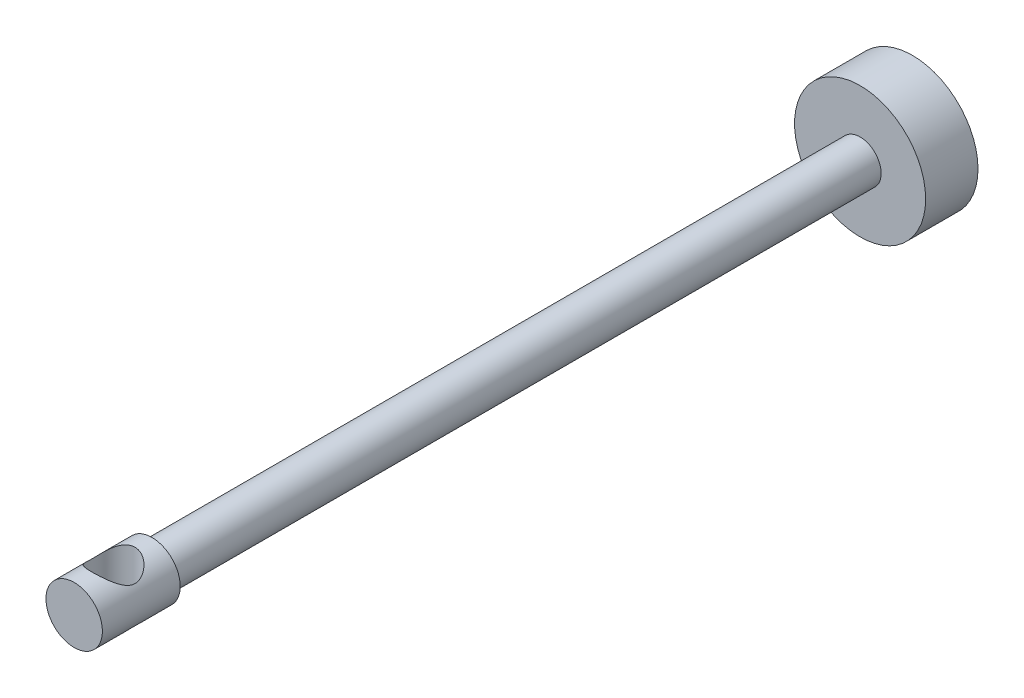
ISO-10303-21;
HEADER;
FILE_DESCRIPTION(('STEP AP214'),'2;1');
FILE_NAME('part.step','',(''),(''),'','','');
FILE_SCHEMA(('AUTOMOTIVE_DESIGN { 1 0 10303 214 1 1 1 1 }'));
ENDSEC;
DATA;
#1=APPLICATION_CONTEXT('core data for automotive mechanical design processes');
#2=APPLICATION_PROTOCOL_DEFINITION('international standard','automotive_design',2000,#1);
#3=PRODUCT_CONTEXT('',#1,'mechanical');
#4=PRODUCT('Part','Part','',(#3));
#5=PRODUCT_RELATED_PRODUCT_CATEGORY('part','',(#4));
#6=PRODUCT_DEFINITION_FORMATION('','',#4);
#7=PRODUCT_DEFINITION_CONTEXT('part definition',#1,'design');
#8=PRODUCT_DEFINITION('design','',#6,#7);
#9=PRODUCT_DEFINITION_SHAPE('','',#8);
#10=(LENGTH_UNIT() NAMED_UNIT(*) SI_UNIT(.MILLI.,.METRE.));
#11=(NAMED_UNIT(*) PLANE_ANGLE_UNIT() SI_UNIT($,.RADIAN.));
#12=(NAMED_UNIT(*) SI_UNIT($,.STERADIAN.) SOLID_ANGLE_UNIT());
#13=UNCERTAINTY_MEASURE_WITH_UNIT(LENGTH_MEASURE(1.E-05),#10,'distance_accuracy_value','');
#14=(GEOMETRIC_REPRESENTATION_CONTEXT(3) GLOBAL_UNCERTAINTY_ASSIGNED_CONTEXT((#13)) GLOBAL_UNIT_ASSIGNED_CONTEXT((#10,
#11,#12)) REPRESENTATION_CONTEXT('',''));
#15=CARTESIAN_POINT('',(0.,0.,0.));
#16=DIRECTION('',(0.,0.,1.));
#17=DIRECTION('',(1.,0.,0.));
#18=AXIS2_PLACEMENT_3D('',#15,#16,#17);
#19=CARTESIAN_POINT('',(0.,0.,93.5482000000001));
#20=DIRECTION('',(0.,0.,-1.));
#21=DIRECTION('',(-1.,0.,0.));
#22=AXIS2_PLACEMENT_3D('',#19,#20,#21);
#23=CYLINDRICAL_SURFACE('',#22,2.3495);
#24=CARTESIAN_POINT('',(0.,0.,5.842));
#25=DIRECTION('',(0.,0.,1.));
#26=DIRECTION('',(1.,0.,0.));
#27=AXIS2_PLACEMENT_3D('',#24,#25,#26);
#28=CIRCLE('',#27,2.3495);
#29=CARTESIAN_POINT('',(2.34950000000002,0.,5.842));
#30=VERTEX_POINT('',#29);
#31=EDGE_CURVE('E97',#30,#30,#28,.F.);
#32=ORIENTED_EDGE('',*,*,#31,.F.);
#33=EDGE_LOOP('',(#32));
#34=FACE_BOUND('',#33,.T.);
#35=CARTESIAN_POINT('',(0.,0.,84.8614000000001));
#36=DIRECTION('',(0.,0.,1.));
#37=DIRECTION('',(1.,0.,0.));
#38=AXIS2_PLACEMENT_3D('',#35,#36,#37);
#39=CIRCLE('',#38,2.3495);
#40=CARTESIAN_POINT('',(2.34950000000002,0.,84.8614000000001));
#41=VERTEX_POINT('',#40);
#42=EDGE_CURVE('E10',#41,#41,#39,.T.);
#43=ORIENTED_EDGE('',*,*,#42,.F.);
#44=EDGE_LOOP('',(#43));
#45=FACE_BOUND('',#44,.T.);
#46=ADVANCED_FACE('F30',(#34,#45),#23,.T.);
#47=CARTESIAN_POINT('',(0.,0.,5.842));
#48=DIRECTION('',(0.,0.,1.));
#49=DIRECTION('',(1.,0.,0.));
#50=AXIS2_PLACEMENT_3D('',#47,#48,#49);
#51=PLANE('',#50);
#52=CARTESIAN_POINT('',(0.,0.,5.842));
#53=DIRECTION('',(0.,0.,1.));
#54=DIRECTION('',(1.,0.,0.));
#55=AXIS2_PLACEMENT_3D('',#52,#53,#54);
#56=CIRCLE('',#55,7.3152);
#57=CARTESIAN_POINT('',(7.31520000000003,0.,5.842));
#58=VERTEX_POINT('',#57);
#59=EDGE_CURVE('E42',#58,#58,#56,.T.);
#60=ORIENTED_EDGE('',*,*,#59,.T.);
#61=EDGE_LOOP('',(#60));
#62=FACE_BOUND('',#61,.T.);
#63=ORIENTED_EDGE('',*,*,#31,.T.);
#64=EDGE_LOOP('',(#63));
#65=FACE_BOUND('',#64,.T.);
#66=ADVANCED_FACE('F77',(#62,#65),#51,.T.);
#67=CARTESIAN_POINT('',(0.,0.,5.842));
#68=DIRECTION('',(0.,0.,-1.));
#69=DIRECTION('',(-1.,0.,0.));
#70=AXIS2_PLACEMENT_3D('',#67,#68,#69);
#71=CYLINDRICAL_SURFACE('',#70,7.3152);
#72=ORIENTED_EDGE('',*,*,#59,.F.);
#73=EDGE_LOOP('',(#72));
#74=FACE_BOUND('',#73,.T.);
#75=CARTESIAN_POINT('',(0.,0.,0.));
#76=DIRECTION('',(0.,0.,1.));
#77=DIRECTION('',(1.,0.,0.));
#78=AXIS2_PLACEMENT_3D('',#75,#76,#77);
#79=CIRCLE('',#78,7.3152);
#80=CARTESIAN_POINT('',(7.31520000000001,0.,0.));
#81=VERTEX_POINT('',#80);
#82=EDGE_CURVE('E47',#81,#81,#79,.T.);
#83=ORIENTED_EDGE('',*,*,#82,.T.);
#84=EDGE_LOOP('',(#83));
#85=FACE_BOUND('',#84,.T.);
#86=ADVANCED_FACE('F32',(#74,#85),#71,.T.);
#87=CARTESIAN_POINT('',(0.,0.,0.));
#88=DIRECTION('',(0.,0.,1.));
#89=DIRECTION('',(1.,0.,0.));
#90=AXIS2_PLACEMENT_3D('',#87,#88,#89);
#91=PLANE('',#90);
#92=ORIENTED_EDGE('',*,*,#82,.F.);
#93=EDGE_LOOP('',(#92));
#94=FACE_BOUND('',#93,.T.);
#95=ADVANCED_FACE('F66',(#94),#91,.F.);
#96=CARTESIAN_POINT('',(0.,0.,84.8614000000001));
#97=DIRECTION('',(0.,0.,1.));
#98=DIRECTION('',(1.,0.,0.));
#99=AXIS2_PLACEMENT_3D('',#96,#97,#98);
#100=PLANE('',#99);
#101=CARTESIAN_POINT('',(0.,0.,84.8614000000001));
#102=DIRECTION('',(0.,0.,1.));
#103=DIRECTION('',(1.,0.,0.));
#104=AXIS2_PLACEMENT_3D('',#101,#102,#103);
#105=CIRCLE('',#104,3.1496);
#106=CARTESIAN_POINT('',(3.14960000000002,0.,84.8614000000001));
#107=VERTEX_POINT('',#106);
#108=EDGE_CURVE('E94',#107,#107,#105,.T.);
#109=ORIENTED_EDGE('',*,*,#108,.F.);
#110=EDGE_LOOP('',(#109));
#111=FACE_BOUND('',#110,.T.);
#112=ORIENTED_EDGE('',*,*,#42,.T.);
#113=EDGE_LOOP('',(#112));
#114=FACE_BOUND('',#113,.T.);
#115=ADVANCED_FACE('F63',(#111,#114),#100,.F.);
#116=CARTESIAN_POINT('',(0.,0.,84.8614000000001));
#117=DIRECTION('',(0.,0.,1.));
#118=DIRECTION('',(1.,0.,0.));
#119=AXIS2_PLACEMENT_3D('',#116,#117,#118);
#120=CYLINDRICAL_SURFACE('',#119,3.1496);
#121=CARTESIAN_POINT('',(0.,-3.14959999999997,91.5543));
#122=CARTESIAN_POINT('',(-0.116753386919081,-3.1495908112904,91.5542904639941));
#123=CARTESIAN_POINT('',(-0.233649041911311,-3.14304210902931,91.5457147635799));
#124=CARTESIAN_POINT('',(-0.463709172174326,-3.11743809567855,91.5119643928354));
#125=CARTESIAN_POINT('',(-0.576865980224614,-3.09835857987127,91.4867575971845));
#126=CARTESIAN_POINT('',(-0.795546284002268,-3.04951955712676,91.4214864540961));
#127=CARTESIAN_POINT('',(-0.901110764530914,-3.01982353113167,91.3815103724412));
#128=CARTESIAN_POINT('',(-1.10331111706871,-2.95196125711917,91.2886053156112));
#129=CARTESIAN_POINT('',(-1.19994820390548,-2.91379616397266,91.2356781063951));
#130=CARTESIAN_POINT('',(-1.39183412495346,-2.82751662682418,91.1131793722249));
#131=CARTESIAN_POINT('',(-1.48611192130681,-2.77880608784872,91.0425155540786));
#132=CARTESIAN_POINT('',(-1.66224686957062,-2.67717756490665,90.8895149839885));
#133=CARTESIAN_POINT('',(-1.74408527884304,-2.62425341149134,90.8071609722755));
#134=CARTESIAN_POINT('',(-1.9107125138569,-2.50631564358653,90.6135250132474));
#135=CARTESIAN_POINT('',(-1.99252333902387,-2.4410934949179,90.4997979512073));
#136=CARTESIAN_POINT('',(-2.13623724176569,-2.31634876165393,90.2575073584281));
#137=CARTESIAN_POINT('',(-2.19816512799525,-2.25681913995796,90.1289625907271));
#138=CARTESIAN_POINT('',(-2.28171742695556,-2.17163210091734,89.9050222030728));
#139=CARTESIAN_POINT('',(-2.30985946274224,-2.1414179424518,89.8138157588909));
#140=CARTESIAN_POINT('',(-2.35538232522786,-2.09124548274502,89.6261204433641));
#141=CARTESIAN_POINT('',(-2.37278826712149,-2.07126326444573,89.5296444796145));
#142=CARTESIAN_POINT('',(-2.39573683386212,-2.04469222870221,89.3323673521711));
#143=CARTESIAN_POINT('',(-2.40115952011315,-2.0382388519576,89.231532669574));
#144=CARTESIAN_POINT('',(-2.3992169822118,-2.04052395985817,89.0301445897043));
#145=CARTESIAN_POINT('',(-2.39184927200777,-2.0492653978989,88.9295912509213));
#146=CARTESIAN_POINT('',(-2.36666505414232,-2.07826123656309,88.7440345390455));
#147=CARTESIAN_POINT('',(-2.35018575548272,-2.09703353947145,88.6585974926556));
#148=CARTESIAN_POINT('',(-2.30880032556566,-2.14251470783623,88.4919876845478));
#149=CARTESIAN_POINT('',(-2.28388546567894,-2.16923179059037,88.4108194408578));
#150=CARTESIAN_POINT('',(-2.20797394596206,-2.24707717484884,88.2025115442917));
#151=CARTESIAN_POINT('',(-2.15051705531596,-2.30284017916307,88.0794623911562));
#152=CARTESIAN_POINT('',(-2.01746799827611,-2.42027547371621,87.8465927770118));
#153=CARTESIAN_POINT('',(-1.9418303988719,-2.48196233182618,87.7368065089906));
#154=CARTESIAN_POINT('',(-1.77089813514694,-2.60680744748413,87.5279351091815));
#155=CARTESIAN_POINT('',(-1.67508616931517,-2.66995496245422,87.4292648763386));
#156=CARTESIAN_POINT('',(-1.46595637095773,-2.79024398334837,87.2483615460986));
#157=CARTESIAN_POINT('',(-1.3526712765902,-2.84739639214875,87.1660983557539));
#158=CARTESIAN_POINT('',(-1.13278231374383,-2.94078675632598,87.0347121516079));
#159=CARTESIAN_POINT('',(-1.02898728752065,-2.97893550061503,86.9822627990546));
#160=CARTESIAN_POINT('',(-0.81210486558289,-3.0452076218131,86.8922126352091));
#161=CARTESIAN_POINT('',(-0.699022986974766,-3.07333689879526,86.8546030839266));
#162=CARTESIAN_POINT('',(-0.465391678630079,-3.11730600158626,86.7961553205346));
#163=CARTESIAN_POINT('',(-0.344797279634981,-3.13306219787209,86.7754312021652));
#164=CARTESIAN_POINT('',(-0.100858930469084,-3.15035337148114,86.7526994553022));
#165=CARTESIAN_POINT('',(0.0224834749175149,-3.15189614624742,86.7506815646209));
#166=CARTESIAN_POINT('',(0.253781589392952,-3.1412566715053,86.7646559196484));
#167=CARTESIAN_POINT('',(0.361934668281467,-3.13056860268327,86.7786874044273));
#168=CARTESIAN_POINT('',(0.573852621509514,-3.09873495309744,86.8208030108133));
#169=CARTESIAN_POINT('',(0.677616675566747,-3.07758742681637,86.8488897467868));
#170=CARTESIAN_POINT('',(0.880898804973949,-3.02576878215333,86.9185379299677));
#171=CARTESIAN_POINT('',(0.980253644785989,-2.99487983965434,86.9604086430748));
#172=CARTESIAN_POINT('',(1.17044099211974,-2.92579860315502,87.0557068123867));
#173=CARTESIAN_POINT('',(1.26127218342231,-2.88760518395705,87.1091360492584));
#174=CARTESIAN_POINT('',(1.44771669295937,-2.79935733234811,87.2356036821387));
#175=CARTESIAN_POINT('',(1.54168278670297,-2.74838464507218,87.3104199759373));
#176=CARTESIAN_POINT('',(1.71658309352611,-2.64268427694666,87.4720355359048));
#177=CARTESIAN_POINT('',(1.79749107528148,-2.58794934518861,87.5588582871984));
#178=CARTESIAN_POINT('',(1.91606853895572,-2.50034531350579,87.7065314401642));
#179=CARTESIAN_POINT('',(1.95810722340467,-2.46746798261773,87.7639178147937));
#180=CARTESIAN_POINT('',(2.03714211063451,-2.40263503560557,87.8825519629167));
#181=CARTESIAN_POINT('',(2.07413652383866,-2.37067974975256,87.9438010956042));
#182=CARTESIAN_POINT('',(2.17711958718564,-2.27784489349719,88.1331234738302));
#183=CARTESIAN_POINT('',(2.23539805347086,-2.21977096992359,88.2671298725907));
#184=CARTESIAN_POINT('',(2.31006415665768,-2.14134043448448,88.4956266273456));
#185=CARTESIAN_POINT('',(2.33394940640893,-2.11505134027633,88.5856464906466));
#186=CARTESIAN_POINT('',(2.37126859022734,-2.07312776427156,88.7701538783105));
#187=CARTESIAN_POINT('',(2.38472767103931,-2.05746765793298,88.8646300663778));
#188=CARTESIAN_POINT('',(2.40026378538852,-2.03933325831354,89.0565659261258));
#189=CARTESIAN_POINT('',(2.40225441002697,-2.03695907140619,89.1540426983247));
#190=CARTESIAN_POINT('',(2.39442674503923,-2.0461488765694,89.347891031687));
#191=CARTESIAN_POINT('',(2.38459766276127,-2.05772560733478,89.4442615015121));
#192=CARTESIAN_POINT('',(2.3516839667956,-2.09529291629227,89.6470689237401));
#193=CARTESIAN_POINT('',(2.32683408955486,-2.12318306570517,89.7528510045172));
#194=CARTESIAN_POINT('',(2.26447746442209,-2.18956301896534,89.9571542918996));
#195=CARTESIAN_POINT('',(2.22693769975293,-2.22808042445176,90.0556557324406));
#196=CARTESIAN_POINT('',(2.1234333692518,-2.32765655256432,90.282556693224));
#197=CARTESIAN_POINT('',(2.05210269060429,-2.39158259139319,90.4072358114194));
#198=CARTESIAN_POINT('',(1.88942507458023,-2.52210030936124,90.6412238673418));
#199=CARTESIAN_POINT('',(1.79805433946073,-2.58869508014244,90.7505142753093));
#200=CARTESIAN_POINT('',(1.59437325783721,-2.71897484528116,90.9541311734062));
#201=CARTESIAN_POINT('',(1.48174765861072,-2.78259522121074,91.0481865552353));
#202=CARTESIAN_POINT('',(1.23757845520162,-2.89941028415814,91.2159512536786));
#203=CARTESIAN_POINT('',(1.10607875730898,-2.95262850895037,91.2897066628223));
#204=CARTESIAN_POINT('',(0.865663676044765,-3.03016134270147,91.3954798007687));
#205=CARTESIAN_POINT('',(0.76059443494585,-3.0583987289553,91.4333998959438));
#206=CARTESIAN_POINT('',(0.54414327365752,-3.10419654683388,91.494494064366));
#207=CARTESIAN_POINT('',(0.43277738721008,-3.12178287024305,91.5177039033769));
#208=CARTESIAN_POINT('',(0.26701182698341,-3.13871392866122,91.5400011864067));
#209=CARTESIAN_POINT('',(0.213847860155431,-3.14278566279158,91.5453525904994));
#210=CARTESIAN_POINT('',(0.107132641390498,-3.14823111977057,91.5525045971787));
#211=CARTESIAN_POINT('',(0.053581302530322,-3.14960421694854,91.5543043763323));
#212=CARTESIAN_POINT('',(0.,-3.14959999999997,91.5543));
#213=B_SPLINE_CURVE_WITH_KNOTS('',3,(#121,#122,#123,#124,#125,#126,#127,#128,#129,#130,#131,
#132,#133,#134,#135,#136,#137,#138,#139,#140,#141,#142,#143,#144,#145,#146,#147,#148,#149,#150,
#151,#152,#153,#154,#155,#156,#157,#158,#159,#160,#161,#162,#163,#164,#165,#166,#167,#168,#169,
#170,#171,#172,#173,#174,#175,#176,#177,#178,#179,#180,#181,#182,#183,#184,#185,#186,#187,#188,
#189,#190,#191,#192,#193,#194,#195,#196,#197,#198,#199,#200,#201,#202,#203,#204,#205,#206,#207,
#208,#209,#210,#211,#212),.UNSPECIFIED.,.T.,.F.,(4,2,2,2,2,2,2,2,2,2,2,2,2,2,2,2,2,2,2,2,2,2,2,
2,2,2,2,2,2,2,2,2,2,2,2,2,2,2,2,2,2,2,2,2,2,4),(0.,0.350030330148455,0.700738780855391,
1.04938432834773,1.39798236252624,1.7791099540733,2.16080622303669,2.62251905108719,
3.08365352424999,3.38302933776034,3.68170213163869,3.9833510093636,4.28505852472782,
4.55112339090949,4.81746441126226,5.25547760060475,5.69459696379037,6.14676413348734,
6.59809417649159,6.96381209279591,7.32931429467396,7.69726615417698,8.06501614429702,
8.39222858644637,8.7195019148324,9.05468517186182,9.38992010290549,9.77997912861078,
10.1708122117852,10.4056602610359,10.6405914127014,11.1089314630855,11.3982846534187,
11.6869377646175,11.9777629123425,12.2688538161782,12.6035543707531,12.939132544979,
13.4083870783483,13.8782019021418,14.3556279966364,14.8319609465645,15.1762345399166,
15.51966784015,15.6802690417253,15.8409074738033),.UNSPECIFIED.);
#214=CARTESIAN_POINT('',(0.,-3.14959999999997,91.5543));
#215=VERTEX_POINT('',#214);
#216=EDGE_CURVE('E34',#215,#215,#213,.T.);
#217=ORIENTED_EDGE('',*,*,#216,.F.);
#218=EDGE_LOOP('',(#217));
#219=FACE_BOUND('',#218,.T.);
#220=CARTESIAN_POINT('',(0.,3.14960000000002,91.5543));
#221=CARTESIAN_POINT('',(0.116753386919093,3.14959081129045,91.5542904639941));
#222=CARTESIAN_POINT('',(0.233649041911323,3.14304210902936,91.5457147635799));
#223=CARTESIAN_POINT('',(0.463709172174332,3.11743809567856,91.5119643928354));
#224=CARTESIAN_POINT('',(0.576865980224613,3.09835857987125,91.4867575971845));
#225=CARTESIAN_POINT('',(0.795546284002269,3.04951955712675,91.4214864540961));
#226=CARTESIAN_POINT('',(0.901110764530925,3.01982353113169,91.3815103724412));
#227=CARTESIAN_POINT('',(1.10331111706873,2.95196125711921,91.2886053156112));
#228=CARTESIAN_POINT('',(1.19994820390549,2.9137961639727,91.2356781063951));
#229=CARTESIAN_POINT('',(1.39183412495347,2.82751662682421,91.1131793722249));
#230=CARTESIAN_POINT('',(1.48611192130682,2.77880608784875,91.0425155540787));
#231=CARTESIAN_POINT('',(1.66224686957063,2.6771775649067,90.8895149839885));
#232=CARTESIAN_POINT('',(1.74408527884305,2.62425341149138,90.8071609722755));
#233=CARTESIAN_POINT('',(1.91071251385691,2.50631564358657,90.6135250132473));
#234=CARTESIAN_POINT('',(1.99252333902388,2.44109349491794,90.4997979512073));
#235=CARTESIAN_POINT('',(2.13623724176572,2.31634876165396,90.2575073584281));
#236=CARTESIAN_POINT('',(2.19816512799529,2.25681913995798,90.1289625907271));
#237=CARTESIAN_POINT('',(2.28171742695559,2.17163210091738,89.9050222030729));
#238=CARTESIAN_POINT('',(2.30985946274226,2.14141794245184,89.8138157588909));
#239=CARTESIAN_POINT('',(2.35538232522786,2.09124548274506,89.6261204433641));
#240=CARTESIAN_POINT('',(2.37278826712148,2.07126326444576,89.5296444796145));
#241=CARTESIAN_POINT('',(2.39573683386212,2.04469222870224,89.3323673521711));
#242=CARTESIAN_POINT('',(2.40115952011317,2.03823885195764,89.231532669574));
#243=CARTESIAN_POINT('',(2.39921698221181,2.04052395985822,89.0301445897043));
#244=CARTESIAN_POINT('',(2.39184927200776,2.04926539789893,88.9295912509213));
#245=CARTESIAN_POINT('',(2.36666505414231,2.07826123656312,88.7440345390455));
#246=CARTESIAN_POINT('',(2.35018575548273,2.0970335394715,88.6585974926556));
#247=CARTESIAN_POINT('',(2.30880032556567,2.14251470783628,88.4919876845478));
#248=CARTESIAN_POINT('',(2.28388546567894,2.16923179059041,88.4108194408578));
#249=CARTESIAN_POINT('',(2.20797394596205,2.24707717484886,88.2025115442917));
#250=CARTESIAN_POINT('',(2.15051705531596,2.3028401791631,88.0794623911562));
#251=CARTESIAN_POINT('',(2.01746799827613,2.42027547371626,87.8465927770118));
#252=CARTESIAN_POINT('',(1.94183039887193,2.48196233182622,87.7368065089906));
#253=CARTESIAN_POINT('',(1.77089813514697,2.60680744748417,87.5279351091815));
#254=CARTESIAN_POINT('',(1.67508616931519,2.66995496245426,87.4292648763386));
#255=CARTESIAN_POINT('',(1.46595637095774,2.7902439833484,87.2483615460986));
#256=CARTESIAN_POINT('',(1.35267127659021,2.84739639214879,87.1660983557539));
#257=CARTESIAN_POINT('',(1.13278231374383,2.94078675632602,87.0347121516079));
#258=CARTESIAN_POINT('',(1.02898728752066,2.97893550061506,86.9822627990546));
#259=CARTESIAN_POINT('',(0.812104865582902,3.04520762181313,86.8922126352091));
#260=CARTESIAN_POINT('',(0.699022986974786,3.0733368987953,86.8546030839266));
#261=CARTESIAN_POINT('',(0.465391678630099,3.11730600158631,86.7961553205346));
#262=CARTESIAN_POINT('',(0.344797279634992,3.13306219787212,86.7754312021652));
#263=CARTESIAN_POINT('',(0.100858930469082,3.15035337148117,86.7526994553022));
#264=CARTESIAN_POINT('',(-0.0224834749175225,3.15189614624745,86.7506815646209));
#265=CARTESIAN_POINT('',(-0.253781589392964,3.14125667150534,86.7646559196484));
#266=CARTESIAN_POINT('',(-0.361934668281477,3.1305686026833,86.7786874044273));
#267=CARTESIAN_POINT('',(-0.573852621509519,3.09873495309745,86.8208030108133));
#268=CARTESIAN_POINT('',(-0.677616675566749,3.07758742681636,86.8488897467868));
#269=CARTESIAN_POINT('',(-0.880898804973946,3.02576878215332,86.9185379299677));
#270=CARTESIAN_POINT('',(-0.980253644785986,2.99487983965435,86.9604086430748));
#271=CARTESIAN_POINT('',(-1.17044099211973,2.92579860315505,87.0557068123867));
#272=CARTESIAN_POINT('',(-1.26127218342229,2.88760518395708,87.1091360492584));
#273=CARTESIAN_POINT('',(-1.44771669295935,2.79935733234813,87.2356036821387));
#274=CARTESIAN_POINT('',(-1.54168278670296,2.74838464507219,87.3104199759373));
#275=CARTESIAN_POINT('',(-1.7165830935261,2.64268427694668,87.4720355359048));
#276=CARTESIAN_POINT('',(-1.79749107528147,2.58794934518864,87.5588582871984));
#277=CARTESIAN_POINT('',(-1.9160685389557,2.50034531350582,87.7065314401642));
#278=CARTESIAN_POINT('',(-1.95810722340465,2.46746798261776,87.7639178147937));
#279=CARTESIAN_POINT('',(-2.03714211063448,2.40263503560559,87.8825519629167));
#280=CARTESIAN_POINT('',(-2.07413652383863,2.37067974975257,87.9438010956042));
#281=CARTESIAN_POINT('',(-2.17711958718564,2.27784489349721,88.1331234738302));
#282=CARTESIAN_POINT('',(-2.23539805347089,2.21977096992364,88.2671298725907));
#283=CARTESIAN_POINT('',(-2.31006415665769,2.14134043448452,88.4956266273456));
#284=CARTESIAN_POINT('',(-2.33394940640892,2.11505134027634,88.5856464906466));
#285=CARTESIAN_POINT('',(-2.37126859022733,2.07312776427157,88.7701538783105));
#286=CARTESIAN_POINT('',(-2.38472767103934,2.05746765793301,88.8646300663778));
#287=CARTESIAN_POINT('',(-2.40026378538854,2.03933325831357,89.0565659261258));
#288=CARTESIAN_POINT('',(-2.40225441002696,2.0369590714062,89.1540426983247));
#289=CARTESIAN_POINT('',(-2.39442674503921,2.04614887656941,89.347891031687));
#290=CARTESIAN_POINT('',(-2.38459766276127,2.05772560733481,89.4442615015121));
#291=CARTESIAN_POINT('',(-2.35168396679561,2.0952929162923,89.6470689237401));
#292=CARTESIAN_POINT('',(-2.32683408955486,2.12318306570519,89.7528510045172));
#293=CARTESIAN_POINT('',(-2.26447746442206,2.18956301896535,89.9571542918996));
#294=CARTESIAN_POINT('',(-2.22693769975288,2.22808042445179,90.0556557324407));
#295=CARTESIAN_POINT('',(-2.12343336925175,2.32765655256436,90.282556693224));
#296=CARTESIAN_POINT('',(-2.05210269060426,2.39158259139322,90.4072358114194));
#297=CARTESIAN_POINT('',(-1.88942507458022,2.52210030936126,90.6412238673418));
#298=CARTESIAN_POINT('',(-1.7980543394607,2.58869508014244,90.7505142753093));
#299=CARTESIAN_POINT('',(-1.59437325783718,2.71897484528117,90.9541311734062));
#300=CARTESIAN_POINT('',(-1.4817476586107,2.78259522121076,91.0481865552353));
#301=CARTESIAN_POINT('',(-1.23757845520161,2.89941028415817,91.2159512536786));
#302=CARTESIAN_POINT('',(-1.10607875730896,2.95262850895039,91.2897066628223));
#303=CARTESIAN_POINT('',(-0.865663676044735,3.03016134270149,91.3954798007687));
#304=CARTESIAN_POINT('',(-0.760594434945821,3.05839872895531,91.4333998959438));
#305=CARTESIAN_POINT('',(-0.544143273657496,3.10419654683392,91.494494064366));
#306=CARTESIAN_POINT('',(-0.43277738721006,3.12178287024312,91.5177039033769));
#307=CARTESIAN_POINT('',(-0.26701182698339,3.13871392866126,91.5400011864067));
#308=CARTESIAN_POINT('',(-0.213847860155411,3.14278566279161,91.5453525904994));
#309=CARTESIAN_POINT('',(-0.10713264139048,3.1482311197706,91.5525045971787));
#310=CARTESIAN_POINT('',(-0.0535813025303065,3.14960421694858,91.5543043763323));
#311=CARTESIAN_POINT('',(0.,3.14960000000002,91.5543));
#312=B_SPLINE_CURVE_WITH_KNOTS('',3,(#220,#221,#222,#223,#224,#225,#226,#227,#228,#229,#230,
#231,#232,#233,#234,#235,#236,#237,#238,#239,#240,#241,#242,#243,#244,#245,#246,#247,#248,#249,
#250,#251,#252,#253,#254,#255,#256,#257,#258,#259,#260,#261,#262,#263,#264,#265,#266,#267,#268,
#269,#270,#271,#272,#273,#274,#275,#276,#277,#278,#279,#280,#281,#282,#283,#284,#285,#286,#287,
#288,#289,#290,#291,#292,#293,#294,#295,#296,#297,#298,#299,#300,#301,#302,#303,#304,#305,#306,
#307,#308,#309,#310,#311),.UNSPECIFIED.,.T.,.F.,(4,2,2,2,2,2,2,2,2,2,2,2,2,2,2,2,2,2,2,2,2,2,2,
2,2,2,2,2,2,2,2,2,2,2,2,2,2,2,2,2,2,2,2,2,2,4),(0.,0.35003033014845,0.700738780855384,
1.04938432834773,1.39798236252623,1.77910995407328,2.16080622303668,2.6225190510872,
3.08365352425,3.38302933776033,3.68170213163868,3.98335100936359,4.28505852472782,
4.5511233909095,4.81746441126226,5.25547760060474,5.69459696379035,6.14676413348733,
6.59809417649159,6.96381209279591,7.32931429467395,7.69726615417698,8.06501614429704,
8.39222858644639,8.71950191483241,9.05468517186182,9.38992010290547,9.77997912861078,
10.1708122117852,10.4056602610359,10.6405914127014,11.1089314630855,11.3982846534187,
11.6869377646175,11.9777629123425,12.2688538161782,12.6035543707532,12.939132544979,
13.4083870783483,13.8782019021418,14.3556279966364,14.8319609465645,15.1762345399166,
15.51966784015,15.6802690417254,15.8409074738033),.UNSPECIFIED.);
#313=CARTESIAN_POINT('',(0.,3.14960000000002,91.5543));
#314=VERTEX_POINT('',#313);
#315=EDGE_CURVE('E50',#314,#314,#312,.T.);
#316=ORIENTED_EDGE('',*,*,#315,.F.);
#317=EDGE_LOOP('',(#316));
#318=FACE_BOUND('',#317,.T.);
#319=ORIENTED_EDGE('',*,*,#108,.T.);
#320=EDGE_LOOP('',(#319));
#321=FACE_BOUND('',#320,.T.);
#322=CARTESIAN_POINT('',(0.,0.,93.5482000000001));
#323=DIRECTION('',(0.,0.,1.));
#324=DIRECTION('',(1.,0.,0.));
#325=AXIS2_PLACEMENT_3D('',#322,#323,#324);
#326=CIRCLE('',#325,3.1496);
#327=CARTESIAN_POINT('',(3.1496,0.,93.5482000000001));
#328=VERTEX_POINT('',#327);
#329=EDGE_CURVE('E92',#328,#328,#326,.T.);
#330=ORIENTED_EDGE('',*,*,#329,.F.);
#331=EDGE_LOOP('',(#330));
#332=FACE_BOUND('',#331,.T.);
#333=ADVANCED_FACE('F54',(#219,#318,#321,#332),#120,.T.);
#334=CARTESIAN_POINT('',(0.,0.,93.5482000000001));
#335=DIRECTION('',(0.,0.,1.));
#336=DIRECTION('',(1.,0.,0.));
#337=AXIS2_PLACEMENT_3D('',#334,#335,#336);
#338=PLANE('',#337);
#339=ORIENTED_EDGE('',*,*,#329,.T.);
#340=EDGE_LOOP('',(#339));
#341=FACE_BOUND('',#340,.T.);
#342=ADVANCED_FACE('F61',(#341),#338,.T.);
#343=CARTESIAN_POINT('',(0.,-7.31519999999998,89.1540000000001));
#344=DIRECTION('',(0.,1.,0.));
#345=DIRECTION('',(0.,0.,1.));
#346=AXIS2_PLACEMENT_3D('',#343,#344,#345);
#347=CYLINDRICAL_SURFACE('',#346,2.4003);
#348=ORIENTED_EDGE('',*,*,#216,.T.);
#349=EDGE_LOOP('',(#348));
#350=FACE_BOUND('',#349,.T.);
#351=ORIENTED_EDGE('',*,*,#315,.T.);
#352=EDGE_LOOP('',(#351));
#353=FACE_BOUND('',#352,.T.);
#354=ADVANCED_FACE('F58',(#350,#353),#347,.F.);
#355=CLOSED_SHELL('',(#46,#66,#86,#95,#115,#333,#342,#354));
#356=MANIFOLD_SOLID_BREP('B2',#355);
#357=ADVANCED_BREP_SHAPE_REPRESENTATION('',(#18,#356),#14);
#358=SHAPE_DEFINITION_REPRESENTATION(#9,#357);
ENDSEC;
END-ISO-10303-21;
